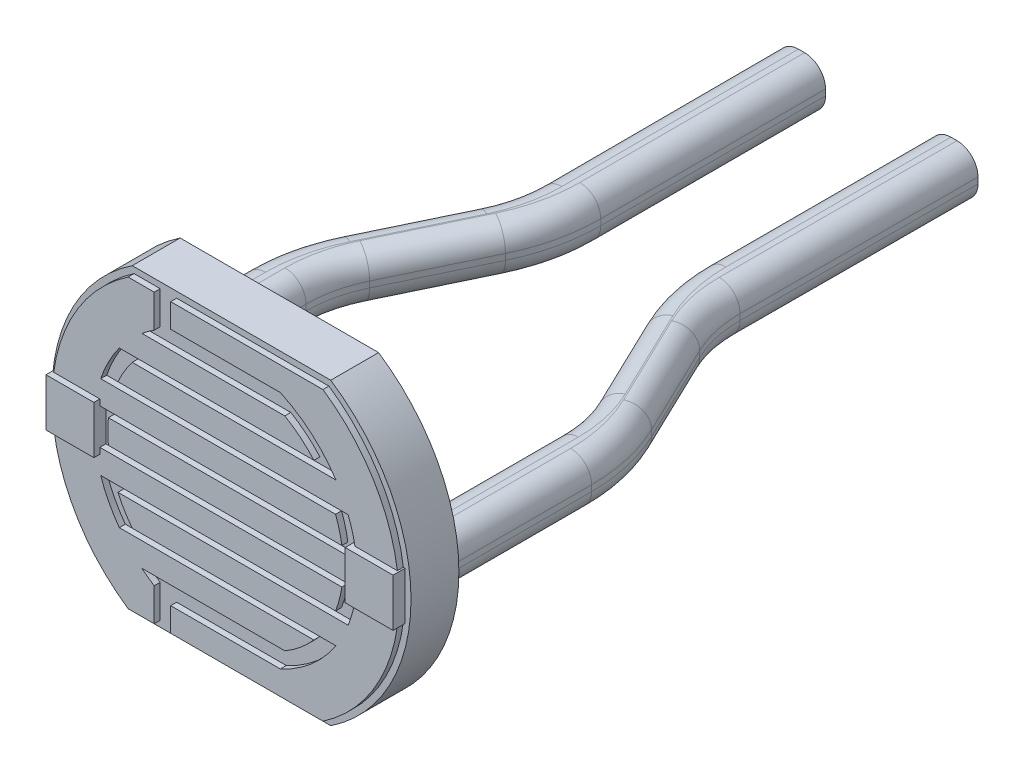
from build123d import *

# Parameters (mm, degrees)
BASE_EXTRUSION_DEPTH = 0.8
BOSS_EXTRU_1_DEPTH   = 0.1
BOSS_EXTRU_2_DEPTH   = 0.4
CONG_1_R             = 0.35


with BuildPart() as part:
    # Esquisse1 → Base-Extrusion (new body)
    with BuildSketch(Plane.XY):
        with BuildLine():
            Line((-1.658312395, 2.5), (1.658312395, 2.5))
            ThreePointArc((1.658312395, 2.5), (3, 0), (1.658312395, -2.5))
            Line((1.658312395, -2.5), (-1.658312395, -2.5))
            ThreePointArc((-1.658312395, -2.5), (-3, 0), (-1.658312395, 2.5))
        make_face()
    extrude(amount=BASE_EXTRUSION_DEPTH)

    # Esquisse2 → Boss.-Extru.1 (add)
    with BuildSketch(Plane.XY.offset(0.8)):
        with BuildLine():
            Line((-0.916515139, -2.4), (1.62788206, -2.4))
            ThreePointArc((1.62788206, -2.4), (2.9, 0), (1.62788206, 2.4))
            Line((1.62788206, 2.4), (-0.916515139, 2.4))
            Line((-0.916515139, 2.4), (-0.916515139, 2))
            Line((-0.916515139, 2), (0.916515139, 2))
            ThreePointArc((0.916515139, 2), (1.437005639, 1.665837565), (1.843908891, 1.2))
            Line((1.843908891, 1.2), (-1.559235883, 1.2))
            ThreePointArc((-1.559235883, 1.2), (-1.690271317, 1.007074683), (-1.797558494, 0.8))
            Line((-1.797558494, 0.8), (2.049390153, 0.8))
            ThreePointArc((2.049390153, 0.8), (2.14126001, 0.50498076), (2.19089023, 0.2))
            Line((2.19089023, 0.2), (-1.957349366, 0.2))
            ThreePointArc((-1.957349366, 0.2), (-1.967540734, 0), (-1.957349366, -0.2))
            Line((-1.957349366, -0.2), (2.19089023, -0.2))
            ThreePointArc((2.19089023, -0.2), (2.14126001, -0.50498076), (2.049390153, -0.8))
            Line((2.049390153, -0.8), (-1.797558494, -0.8))
            ThreePointArc((-1.797558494, -0.8), (-1.690271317, -1.007074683), (-1.559235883, -1.2))
            Line((-1.559235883, -1.2), (1.843908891, -1.2))
            ThreePointArc((1.843908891, -1.2), (1.437005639, -1.665837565), (0.916515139, -2))
            Line((0.916515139, -2), (-0.916515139, -2))
            Line((-0.916515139, -2), (-0.916515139, -2.4))
        make_face()
        with BuildLine():
            Line((-1.191577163, -1.849363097), (-1.191577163, -2.4))
            Line((-1.191577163, -2.4), (-1.62788206, -2.4))
            ThreePointArc((-1.62788206, -2.4), (-2.9, 0), (-1.62788206, 2.4))
            Line((-1.62788206, 2.4), (-1.191577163, 2.4))
            Line((-1.191577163, 2.4), (-1.191577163, 1.849363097))
            ThreePointArc((-1.191577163, 1.849363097), (-1.296153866, 1.777634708), (-1.396424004, 1.7))
            Line((-1.396424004, 1.7), (0.990563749, 1.7))
            ThreePointArc((0.990563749, 1.7), (1.249834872, 1.51958196), (1.476894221, 1.3))
            Line((1.476894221, 1.3), (-1.774823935, 1.3))
            ThreePointArc((-1.774823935, 1.3), (-1.953418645, 1.01200573), (-2.085665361, 0.7))
            Line((-2.085665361, 0.7), (1.838808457, 0.7))
            ThreePointArc((1.838808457, 0.7), (1.902215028, 0.502786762), (1.944535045, 0.3))
            Line((1.944535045, 0.3), (-2.179449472, 0.3))
            ThreePointArc((-2.179449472, 0.3), (-2.2, 0), (-2.179449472, -0.3))
            Line((-2.179449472, -0.3), (1.944535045, -0.3))
            ThreePointArc((1.944535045, -0.3), (1.902215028, -0.502786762), (1.838808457, -0.7))
            Line((1.838808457, -0.7), (-2.085665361, -0.7))
            ThreePointArc((-2.085665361, -0.7), (-1.953418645, -1.01200573), (-1.774823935, -1.3))
            Line((-1.774823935, -1.3), (1.476894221, -1.3))
            ThreePointArc((1.476894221, -1.3), (1.249834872, -1.51958196), (0.990563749, -1.7))
            Line((0.990563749, -1.7), (-1.396424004, -1.7))
            ThreePointArc((-1.396424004, -1.7), (-1.296153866, -1.777634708), (-1.191577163, -1.849363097))
        make_face()
    extrude(amount=BOSS_EXTRU_1_DEPTH)

    # Esquisse11 → Boss.-Extru.2 (add, symmetric)
    with BuildSketch(Plane(origin=(0, 0, 0), x_dir=(1, 0, 0), z_dir=(0, 1, 0))):
        with BuildLine():
            Line((-1.675077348, 10), (-0.872636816, 10))
            Line((-0.872636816, 10), (-0.87164609, 6.242574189))
            ThreePointArc((-0.87164609, 6.242574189), (-0.946348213, 5.576476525), (-1.167076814, 4.943589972))
            Line((-1.167076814, 4.943589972), (-1.903046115, 3.410320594))
            ThreePointArc((-1.903046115, 3.410320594), (-2.050140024, 2.988653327), (-2.1, 2.544858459))
            Line((-2.1, 2.544858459), (-2.1, -1))
            Line((-2.1, -1), (-2.9, -1))
            Line((-2.9, -1), (-2.9, 2.317287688))
            ThreePointArc((-2.9, 2.317287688), (-2.825210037, 2.98297999), (-2.604569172, 3.615480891))
            Line((-2.604569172, 3.615480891), (-1.861434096, 5.163678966))
            ThreePointArc((-1.861434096, 5.163678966), (-1.713749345, 5.587950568), (-1.664487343, 6.034482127))
            Line((-1.664487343, 6.034482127), (-1.675077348, 10))
        make_face()
        with BuildLine():
            Line((1.675077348, 10), (0.872636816, 10))
            Line((0.872636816, 10), (0.87164609, 6.242574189))
            ThreePointArc((0.87164609, 6.242574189), (0.946348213, 5.576476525), (1.167076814, 4.943589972))
            Line((1.167076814, 4.943589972), (1.903046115, 3.410320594))
            ThreePointArc((1.903046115, 3.410320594), (2.050140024, 2.988653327), (2.1, 2.544858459))
            Line((2.1, 2.544858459), (2.1, -1))
            Line((2.1, -1), (2.9, -1))
            Line((2.9, -1), (2.9, 2.317287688))
            ThreePointArc((2.9, 2.317287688), (2.825210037, 2.98297999), (2.604569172, 3.615480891))
            Line((2.604569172, 3.615480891), (1.861434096, 5.163678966))
            ThreePointArc((1.861434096, 5.163678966), (1.713749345, 5.587950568), (1.664487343, 6.034482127))
            Line((1.664487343, 6.034482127), (1.675077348, 10))
        make_face()
    extrude(amount=BOSS_EXTRU_2_DEPTH, both=True)

    # Cong_1
    cong_1_edges = [part.edges().sort_by_distance(p)[0] for p in [
        (-2.9, -0.4, -1.158643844),
        (-2.1, -0.4, -1.272429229),
        (-2.1, 0.4, -1.272429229),
        (-2.050140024, 0.4, -2.988653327),
        (-1.535061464, 0.4, -4.176955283),
        (-0.946348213, 0.4, -5.576476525),
        (-0.872141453, 0.4, -8.121287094),
        (-1.669782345, 0.4, -8.017241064),
        (-1.713749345, 0.4, -5.587950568),
        (-2.233001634, 0.4, -4.389579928),
        (-2.825210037, 0.4, -2.98297999),
        (-2.9, 0.4, -1.158643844),
        (-2.050140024, -0.4, -2.988653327),
        (-1.535061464, -0.4, -4.176955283),
        (-0.946348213, -0.4, -5.576476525),
        (-0.872141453, -0.4, -8.121287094),
        (-1.669782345, -0.4, -8.017241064),
        (-1.713749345, -0.4, -5.587950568),
        (-2.233001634, -0.4, -4.389579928),
        (-2.825210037, -0.4, -2.98297999),
        (2.1, -0.4, -1.272429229),
        (2.9, -0.4, -1.158643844),
        (2.9, 0.4, -1.158643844),
        (2.825210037, 0.4, -2.98297999),
        (2.233001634, 0.4, -4.389579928),
        (1.713749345, 0.4, -5.587950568),
        (1.669782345, 0.4, -8.017241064),
        (0.872141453, 0.4, -8.121287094),
        (0.946348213, 0.4, -5.576476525),
        (1.535061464, 0.4, -4.176955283),
        (2.050140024, 0.4, -2.988653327),
        (2.1, 0.4, -1.272429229),
        (1.669782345, -0.4, -8.017241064),
        (0.872141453, -0.4, -8.121287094),
        (0.946348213, -0.4, -5.576476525),
        (1.535061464, -0.4, -4.176955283),
        (2.050140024, -0.4, -2.988653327),
        (2.825210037, -0.4, -2.98297999),
        (2.233001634, -0.4, -4.389579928),
        (1.713749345, -0.4, -5.587950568),
    ]]
    fillet(cong_1_edges, radius=CONG_1_R)


solid = part.part
